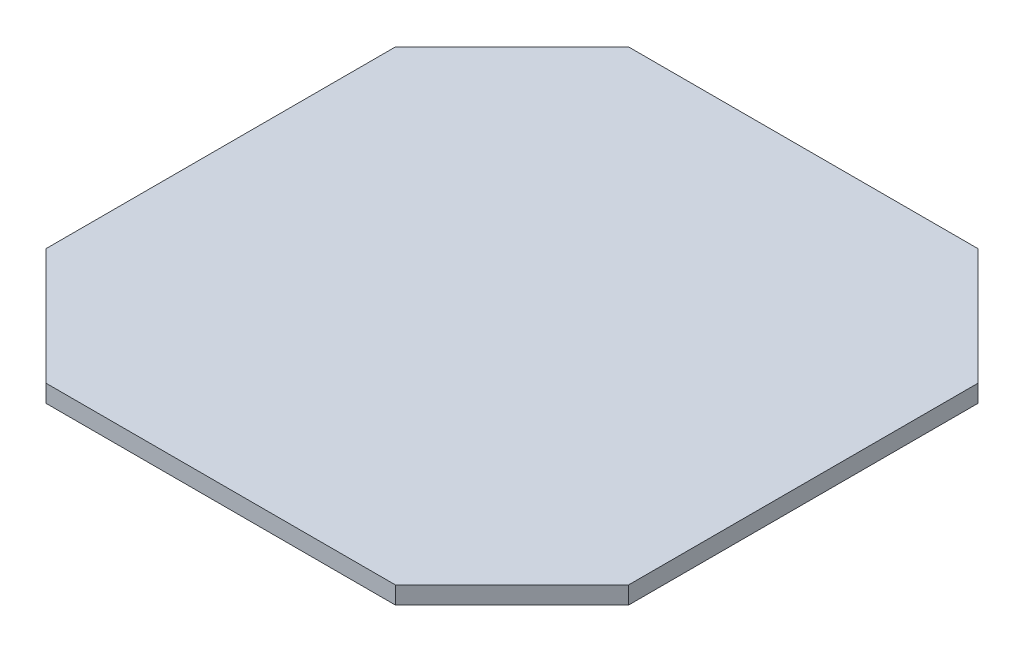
from build123d import *

# Parameters (mm, degrees)
SKETCH2_W           = 127
SKETCH2_H           = 127
BOSS_EXTRUDE1_DEPTH = 3.81
CHAMFER1_SIZE       = 25.4


with BuildPart() as part:
    # Sketch2 → Boss-Extrude1 (new body)
    with BuildSketch(Plane(origin=(0, 0, 0), x_dir=(1, 0, 0), z_dir=(0, 1, 0))):
        Rectangle(SKETCH2_W, SKETCH2_H)
    extrude(amount=BOSS_EXTRUDE1_DEPTH)

    # Chamfer1
    chamfer1_edges = [part.edges().sort_by_distance(p)[0] for p in [
        (-63.5, 1.905, -63.5),
        (63.5, 1.905, -63.5),
        (63.5, 1.905, 63.5),
        (-63.5, 1.905, 63.5),
    ]]
    chamfer(chamfer1_edges, length=CHAMFER1_SIZE)


solid = part.part
